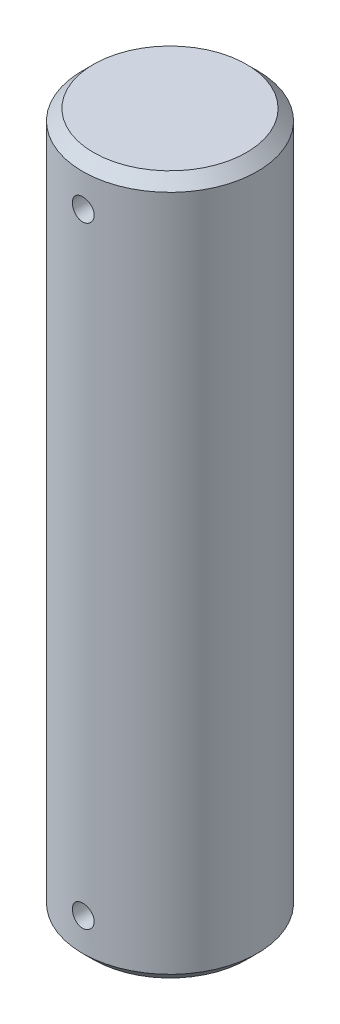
ISO-10303-21;
HEADER;
FILE_DESCRIPTION(('STEP AP214'),'2;1');
FILE_NAME('part.step','',(''),(''),'','','');
FILE_SCHEMA(('AUTOMOTIVE_DESIGN { 1 0 10303 214 1 1 1 1 }'));
ENDSEC;
DATA;
#1=APPLICATION_CONTEXT('core data for automotive mechanical design processes');
#2=APPLICATION_PROTOCOL_DEFINITION('international standard','automotive_design',2000,#1);
#3=PRODUCT_CONTEXT('',#1,'mechanical');
#4=PRODUCT('Part','Part','',(#3));
#5=PRODUCT_RELATED_PRODUCT_CATEGORY('part','',(#4));
#6=PRODUCT_DEFINITION_FORMATION('','',#4);
#7=PRODUCT_DEFINITION_CONTEXT('part definition',#1,'design');
#8=PRODUCT_DEFINITION('design','',#6,#7);
#9=PRODUCT_DEFINITION_SHAPE('','',#8);
#10=(LENGTH_UNIT() NAMED_UNIT(*) SI_UNIT(.MILLI.,.METRE.));
#11=(NAMED_UNIT(*) PLANE_ANGLE_UNIT() SI_UNIT($,.RADIAN.));
#12=(NAMED_UNIT(*) SI_UNIT($,.STERADIAN.) SOLID_ANGLE_UNIT());
#13=UNCERTAINTY_MEASURE_WITH_UNIT(LENGTH_MEASURE(1.E-05),#10,'distance_accuracy_value','');
#14=(GEOMETRIC_REPRESENTATION_CONTEXT(3) GLOBAL_UNCERTAINTY_ASSIGNED_CONTEXT((#13)) GLOBAL_UNIT_ASSIGNED_CONTEXT((#10,
#11,#12)) REPRESENTATION_CONTEXT('',''));
#15=CARTESIAN_POINT('',(0.,0.,0.));
#16=DIRECTION('',(0.,0.,1.));
#17=DIRECTION('',(1.,0.,0.));
#18=AXIS2_PLACEMENT_3D('',#15,#16,#17);
#19=CARTESIAN_POINT('',(0.,101.6,0.));
#20=DIRECTION('',(0.,-1.,0.));
#21=DIRECTION('',(0.,0.,-1.));
#22=AXIS2_PLACEMENT_3D('',#19,#20,#21);
#23=CYLINDRICAL_SURFACE('',#22,25.4);
#24=CARTESIAN_POINT('',(0.,98.425,0.));
#25=DIRECTION('',(0.,1.,0.));
#26=DIRECTION('',(0.,0.,1.));
#27=AXIS2_PLACEMENT_3D('',#24,#25,#26);
#28=CIRCLE('',#27,25.4);
#29=CARTESIAN_POINT('',(0.,98.425,25.4));
#30=VERTEX_POINT('',#29);
#31=EDGE_CURVE('E38',#30,#30,#28,.F.);
#32=ORIENTED_EDGE('',*,*,#31,.T.);
#33=EDGE_LOOP('',(#32));
#34=FACE_BOUND('',#33,.T.);
#35=CARTESIAN_POINT('',(0.,-98.425,0.));
#36=DIRECTION('',(0.,1.,0.));
#37=DIRECTION('',(0.,0.,1.));
#38=AXIS2_PLACEMENT_3D('',#35,#36,#37);
#39=CIRCLE('',#38,25.4);
#40=CARTESIAN_POINT('',(0.,-98.425,25.4));
#41=VERTEX_POINT('',#40);
#42=EDGE_CURVE('E42',#41,#41,#39,.T.);
#43=ORIENTED_EDGE('',*,*,#42,.T.);
#44=EDGE_LOOP('',(#43));
#45=FACE_BOUND('',#44,.T.);
#46=CARTESIAN_POINT('',(0.,-85.725,-25.4));
#47=CARTESIAN_POINT('',(-0.177598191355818,-85.7250075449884,-25.3999975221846));
#48=CARTESIAN_POINT('',(-0.355307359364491,-85.739951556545,-25.3981176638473));
#49=CARTESIAN_POINT('',(-0.705780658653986,-85.7993302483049,-25.3907993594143));
#50=CARTESIAN_POINT('',(-0.878539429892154,-85.8437957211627,-25.3853571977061));
#51=CARTESIAN_POINT('',(-1.21398738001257,-85.9608868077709,-25.371527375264));
#52=CARTESIAN_POINT('',(-1.37668325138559,-86.0334934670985,-25.3631416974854));
#53=CARTESIAN_POINT('',(-1.68754993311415,-86.2047644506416,-25.3443575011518));
#54=CARTESIAN_POINT('',(-1.83572322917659,-86.303424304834,-25.3339593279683));
#55=CARTESIAN_POINT('',(-2.11418527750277,-86.5245817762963,-25.3122470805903));
#56=CARTESIAN_POINT('',(-2.24438256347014,-86.6471941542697,-25.3009287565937));
#57=CARTESIAN_POINT('',(-2.48240904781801,-86.9125297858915,-25.2786861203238));
#58=CARTESIAN_POINT('',(-2.59023710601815,-87.0552540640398,-25.2677618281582));
#59=CARTESIAN_POINT('',(-2.7808049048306,-87.3573563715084,-25.2475022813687));
#60=CARTESIAN_POINT('',(-2.86345896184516,-87.5167888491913,-25.2381725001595));
#61=CARTESIAN_POINT('',(-3.00078530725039,-87.8474075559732,-25.2222143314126));
#62=CARTESIAN_POINT('',(-3.05545865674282,-88.0185933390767,-25.2155858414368));
#63=CARTESIAN_POINT('',(-3.13499370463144,-88.3669101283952,-25.2058213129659));
#64=CARTESIAN_POINT('',(-3.16000982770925,-88.5440053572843,-25.2026671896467));
#65=CARTESIAN_POINT('',(-3.17999814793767,-88.8999063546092,-25.2001531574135));
#66=CARTESIAN_POINT('',(-3.17497155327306,-89.0787120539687,-25.2007930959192));
#67=CARTESIAN_POINT('',(-3.13514389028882,-89.431882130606,-25.2057783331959));
#68=CARTESIAN_POINT('',(-3.10051292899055,-89.6062660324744,-25.2101024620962));
#69=CARTESIAN_POINT('',(-3.00272498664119,-89.9467276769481,-25.2219358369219));
#70=CARTESIAN_POINT('',(-2.9395674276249,-90.1128052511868,-25.2294451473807));
#71=CARTESIAN_POINT('',(-2.78633626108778,-90.4324683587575,-25.2468267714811));
#72=CARTESIAN_POINT('',(-2.69618873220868,-90.5860180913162,-25.2567055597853));
#73=CARTESIAN_POINT('',(-2.49158946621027,-90.8758745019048,-25.2777080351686));
#74=CARTESIAN_POINT('',(-2.37713661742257,-91.0121803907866,-25.2888317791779));
#75=CARTESIAN_POINT('',(-2.12623287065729,-91.2646672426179,-25.3111648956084));
#76=CARTESIAN_POINT('',(-1.9896353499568,-91.3807025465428,-25.3223743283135));
#77=CARTESIAN_POINT('',(-1.69882460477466,-91.5882202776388,-25.3435438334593));
#78=CARTESIAN_POINT('',(-1.54461133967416,-91.6797026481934,-25.3535039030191));
#79=CARTESIAN_POINT('',(-1.2228343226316,-91.8355177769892,-25.371058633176));
#80=CARTESIAN_POINT('',(-1.05526610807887,-91.8998414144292,-25.3786524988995));
#81=CARTESIAN_POINT('',(-0.711591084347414,-91.9993975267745,-25.3906119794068));
#82=CARTESIAN_POINT('',(-0.53548467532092,-92.0346313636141,-25.3949777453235));
#83=CARTESIAN_POINT('',(-0.180991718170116,-92.0748189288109,-25.3999694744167));
#84=CARTESIAN_POINT('',(-0.00262825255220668,-92.0799733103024,-25.4006202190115));
#85=CARTESIAN_POINT('',(0.352419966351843,-92.0603851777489,-25.398175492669));
#86=CARTESIAN_POINT('',(0.529104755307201,-92.0356433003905,-25.3950801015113));
#87=CARTESIAN_POINT('',(0.875188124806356,-91.9571316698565,-25.38550636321));
#88=CARTESIAN_POINT('',(1.0446087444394,-91.9034575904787,-25.3790391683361));
#89=CARTESIAN_POINT('',(1.3720440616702,-91.7687046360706,-25.3634458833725));
#90=CARTESIAN_POINT('',(1.53005837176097,-91.6876248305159,-25.3543197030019));
#91=CARTESIAN_POINT('',(1.83109174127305,-91.4998765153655,-25.3343641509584));
#92=CARTESIAN_POINT('',(1.97402927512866,-91.3930782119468,-25.3235262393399));
#93=CARTESIAN_POINT('',(2.24002217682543,-91.1571081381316,-25.3013863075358));
#94=CARTESIAN_POINT('',(2.36307675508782,-91.0279354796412,-25.2900842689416));
#95=CARTESIAN_POINT('',(2.5865225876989,-90.7499995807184,-25.2682134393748));
#96=CARTESIAN_POINT('',(2.68678083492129,-90.6011290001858,-25.2576491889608));
#97=CARTESIAN_POINT('',(2.86086916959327,-90.2885440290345,-25.2385247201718));
#98=CARTESIAN_POINT('',(2.93469978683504,-90.1248299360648,-25.229964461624));
#99=CARTESIAN_POINT('',(3.05362175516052,-89.7876343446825,-25.215848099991));
#100=CARTESIAN_POINT('',(3.09878809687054,-89.6141796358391,-25.2102841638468));
#101=CARTESIAN_POINT('',(3.15934089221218,-89.2620738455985,-25.2027679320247));
#102=CARTESIAN_POINT('',(3.17472873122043,-89.0834230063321,-25.2008154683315));
#103=CARTESIAN_POINT('',(3.17526230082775,-88.72731945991,-25.2007481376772));
#104=CARTESIAN_POINT('',(3.16061699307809,-88.5498670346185,-25.2026067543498));
#105=CARTESIAN_POINT('',(3.10194249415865,-88.1999669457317,-25.2098951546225));
#106=CARTESIAN_POINT('',(3.05791329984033,-88.0275192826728,-25.2153249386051));
#107=CARTESIAN_POINT('',(2.94178618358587,-87.6925513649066,-25.2291356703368));
#108=CARTESIAN_POINT('',(2.86969832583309,-87.5300275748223,-25.2375155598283));
#109=CARTESIAN_POINT('',(2.6995207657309,-87.2193497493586,-25.2562840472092));
#110=CARTESIAN_POINT('',(2.60143073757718,-87.0711958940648,-25.2666726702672));
#111=CARTESIAN_POINT('',(2.38125804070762,-86.7923953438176,-25.2883746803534));
#112=CARTESIAN_POINT('',(2.2590196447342,-86.6618720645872,-25.2996937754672));
#113=CARTESIAN_POINT('',(1.99434478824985,-86.4231103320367,-25.3219309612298));
#114=CARTESIAN_POINT('',(1.85190357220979,-86.3148771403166,-25.3328489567));
#115=CARTESIAN_POINT('',(1.55024533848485,-86.1234175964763,-25.3530996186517));
#116=CARTESIAN_POINT('',(1.39096658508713,-86.0402879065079,-25.3624260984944));
#117=CARTESIAN_POINT('',(1.06068228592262,-85.9020745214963,-25.3783801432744));
#118=CARTESIAN_POINT('',(0.889689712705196,-85.8469603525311,-25.3850106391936));
#119=CARTESIAN_POINT('',(0.598177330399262,-85.7795346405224,-25.3932273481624));
#120=CARTESIAN_POINT('',(0.479495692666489,-85.7591135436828,-25.3957547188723));
#121=CARTESIAN_POINT('',(0.240559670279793,-85.7318437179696,-25.3991418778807));
#122=CARTESIAN_POINT('',(0.120305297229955,-85.7249948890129,-25.4000016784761));
#123=CARTESIAN_POINT('',(0.,-85.725,-25.4));
#124=B_SPLINE_CURVE_WITH_KNOTS('',3,(#46,#47,#48,#49,#50,#51,#52,#53,#54,#55,#56,#57,#58,#59,
#60,#61,#62,#63,#64,#65,#66,#67,#68,#69,#70,#71,#72,#73,#74,#75,#76,#77,#78,#79,#80,#81,#82,#83,
#84,#85,#86,#87,#88,#89,#90,#91,#92,#93,#94,#95,#96,#97,#98,#99,#100,#101,#102,#103,#104,#105,
#106,#107,#108,#109,#110,#111,#112,#113,#114,#115,#116,#117,#118,#119,#120,#121,#122,#123),
.UNSPECIFIED.,.T.,.F.,(4,2,2,2,2,2,2,2,2,2,2,2,2,2,2,2,2,2,2,2,2,2,2,2,2,2,2,2,2,2,2,2,2,2,2,2,
2,2,4),(0.,0.532355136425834,1.06526642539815,1.59781939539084,2.13028105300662,2.6653593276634,
3.20046486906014,3.73737187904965,4.27425852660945,4.80833716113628,5.34239431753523,
5.87340324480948,6.40442293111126,6.93691051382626,7.46942245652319,8.00561617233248,
8.54181112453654,9.07818600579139,9.61453577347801,10.1473035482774,10.6800599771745,
11.2110653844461,11.7420888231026,12.2758505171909,12.8096334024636,13.3464550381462,
13.8832659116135,14.4186665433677,14.9540422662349,15.4857056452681,16.0173690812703,
16.5488419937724,17.0803215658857,17.6153475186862,18.1504996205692,18.687686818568,
19.2242884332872,19.5849093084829,19.9455275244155),.UNSPECIFIED.);
#125=CARTESIAN_POINT('',(0.,-85.725,-25.4));
#126=VERTEX_POINT('',#125);
#127=EDGE_CURVE('E52',#126,#126,#124,.T.);
#128=ORIENTED_EDGE('',*,*,#127,.T.);
#129=EDGE_LOOP('',(#128));
#130=FACE_BOUND('',#129,.T.);
#131=CARTESIAN_POINT('',(3.17500000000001,-88.9,25.2007812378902));
#132=CARTESIAN_POINT('',(3.1749924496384,-89.0775920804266,25.2007837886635));
#133=CARTESIAN_POINT('',(3.16004943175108,-89.2552951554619,25.2026787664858));
#134=CARTESIAN_POINT('',(3.10067504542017,-89.6057557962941,25.2100510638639));
#135=CARTESIAN_POINT('',(3.05621286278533,-89.7785079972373,25.2155321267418));
#136=CARTESIAN_POINT('',(2.93913139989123,-90.1139420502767,25.2294462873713));
#137=CARTESIAN_POINT('',(2.86653123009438,-90.2766306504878,25.2378773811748));
#138=CARTESIAN_POINT('',(2.69527553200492,-90.5874851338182,25.2567392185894));
#139=CARTESIAN_POINT('',(2.59662445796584,-90.7356534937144,25.2671696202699));
#140=CARTESIAN_POINT('',(2.37547588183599,-91.0141210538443,25.2889202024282));
#141=CARTESIAN_POINT('',(2.25286165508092,-91.1443272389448,25.3002445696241));
#142=CARTESIAN_POINT('',(1.98751858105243,-91.3823709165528,25.3224694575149));
#143=CARTESIAN_POINT('',(1.84478873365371,-91.4902072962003,25.333369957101));
#144=CARTESIAN_POINT('',(1.54268148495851,-91.680783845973,25.3535617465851));
#145=CARTESIAN_POINT('',(1.38325059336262,-91.7634398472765,25.362847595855));
#146=CARTESIAN_POINT('',(1.05263533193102,-91.900770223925,25.3787178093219));
#147=CARTESIAN_POINT('',(0.881451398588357,-91.9554456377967,25.3853022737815));
#148=CARTESIAN_POINT('',(0.533140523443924,-92.0349849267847,25.3949983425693));
#149=CARTESIAN_POINT('',(0.356049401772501,-92.0600034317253,25.3981279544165));
#150=CARTESIAN_POINT('',(0.000156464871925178,-92.0799979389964,25.400623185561));
#151=CARTESIAN_POINT('',(-0.178645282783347,-92.0749751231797,25.3999889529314));
#152=CARTESIAN_POINT('',(-0.531831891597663,-92.0351534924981,25.3950425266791));
#153=CARTESIAN_POINT('',(-0.706235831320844,-92.0005209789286,25.3907508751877));
#154=CARTESIAN_POINT('',(-1.04673674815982,-91.90272300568,25.3789949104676));
#155=CARTESIAN_POINT('',(-1.21283356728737,-91.8395570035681,25.3715305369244));
#156=CARTESIAN_POINT('',(-1.53252019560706,-91.6863082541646,25.3542324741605));
#157=CARTESIAN_POINT('',(-1.68607514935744,-91.5961535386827,25.3443924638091));
#158=CARTESIAN_POINT('',(-1.97593896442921,-91.3915388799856,25.3234440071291));
#159=CARTESIAN_POINT('',(-2.11224703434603,-91.2770778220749,25.3123355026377));
#160=CARTESIAN_POINT('',(-2.36472479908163,-91.02616819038,25.2900036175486));
#161=CARTESIAN_POINT('',(-2.4807504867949,-90.8895746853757,25.27877997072));
#162=CARTESIAN_POINT('',(-2.68825072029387,-90.5987754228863,25.2575577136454));
#163=CARTESIAN_POINT('',(-2.77972518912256,-90.4445696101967,25.2475591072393));
#164=CARTESIAN_POINT('',(-2.93553460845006,-90.1227947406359,25.2299190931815));
#165=CARTESIAN_POINT('',(-2.99985802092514,-89.9552200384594,25.2222786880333));
#166=CARTESIAN_POINT('',(-3.09941170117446,-89.6115308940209,25.2102396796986));
#167=CARTESIAN_POINT('',(-3.1346433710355,-89.4354168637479,25.2058409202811));
#168=CARTESIAN_POINT('',(-3.17482274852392,-89.0809201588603,25.2008117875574));
#169=CARTESIAN_POINT('',(-3.17997311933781,-88.9025607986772,25.2001561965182));
#170=CARTESIAN_POINT('',(-3.1603784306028,-88.5475217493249,25.2026209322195));
#171=CARTESIAN_POINT('',(-3.13563400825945,-88.3708420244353,25.2057411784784));
#172=CARTESIAN_POINT('',(-3.0571227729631,-88.0247848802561,25.2153830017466));
#173=CARTESIAN_POINT('',(-3.00345409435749,-87.8553848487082,25.2218930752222));
#174=CARTESIAN_POINT('',(-2.86871882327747,-87.5279883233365,25.2375716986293));
#175=CARTESIAN_POINT('',(-2.78765126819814,-87.3699922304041,25.2467403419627));
#176=CARTESIAN_POINT('',(-2.59992116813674,-87.0689716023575,25.2667634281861));
#177=CARTESIAN_POINT('',(-2.49312572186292,-86.9260305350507,25.2776265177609));
#178=CARTESIAN_POINT('',(-2.25715924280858,-86.6600291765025,25.299787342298));
#179=CARTESIAN_POINT('',(-2.12798733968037,-86.5369696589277,25.3110850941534));
#180=CARTESIAN_POINT('',(-1.85004935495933,-86.3135126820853,25.3329197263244));
#181=CARTESIAN_POINT('',(-1.70117578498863,-86.2132483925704,25.343451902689));
#182=CARTESIAN_POINT('',(-1.38858317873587,-86.0391494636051,25.3624983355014));
#183=CARTESIAN_POINT('',(-1.22486444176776,-85.9653142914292,25.371012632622));
#184=CARTESIAN_POINT('',(-0.8876714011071,-85.8463894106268,25.3850430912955));
#185=CARTESIAN_POINT('',(-0.714224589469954,-85.8012227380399,25.3905672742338));
#186=CARTESIAN_POINT('',(-0.362135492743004,-85.740666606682,25.3980283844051));
#187=CARTESIAN_POINT('',(-0.183493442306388,-85.725275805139,25.3999654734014));
#188=CARTESIAN_POINT('',(0.172614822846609,-85.724733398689,25.4000333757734));
#189=CARTESIAN_POINT('',(0.35008075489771,-85.7393764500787,25.3981900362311));
#190=CARTESIAN_POINT('',(0.700008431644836,-85.7980511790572,25.3909555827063));
#191=CARTESIAN_POINT('',(0.872470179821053,-85.842082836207,25.3855644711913));
#192=CARTESIAN_POINT('',(1.20746703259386,-85.958220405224,25.371837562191));
#193=CARTESIAN_POINT('',(1.37000559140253,-86.0303164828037,25.363502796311));
#194=CARTESIAN_POINT('',(1.68070953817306,-86.2005150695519,25.3448114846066));
#195=CARTESIAN_POINT('',(1.82887475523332,-86.2986178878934,25.3344549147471));
#196=CARTESIAN_POINT('',(2.10767519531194,-86.5188048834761,25.3127915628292));
#197=CARTESIAN_POINT('',(2.23818931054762,-86.6410418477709,25.3014790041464));
#198=CARTESIAN_POINT('',(2.47693322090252,-86.9057100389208,25.2792250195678));
#199=CARTESIAN_POINT('',(2.58515773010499,-87.048146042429,25.2682836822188));
#200=CARTESIAN_POINT('',(2.77660765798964,-87.3497998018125,25.247965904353));
#201=CARTESIAN_POINT('',(2.85973492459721,-87.5090802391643,25.2385956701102));
#202=CARTESIAN_POINT('',(2.99794331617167,-87.8393680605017,25.2225537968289));
#203=CARTESIAN_POINT('',(3.05305494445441,-88.0103624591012,25.2158792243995));
#204=CARTESIAN_POINT('',(3.12047368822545,-88.3018680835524,25.2076049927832));
#205=CARTESIAN_POINT('',(3.14089164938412,-88.4205406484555,25.2050588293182));
#206=CARTESIAN_POINT('',(3.16815731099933,-88.6594585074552,25.20164609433));
#207=CARTESIAN_POINT('',(3.17500511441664,-88.7797037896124,25.2007795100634));
#208=CARTESIAN_POINT('',(3.17500000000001,-88.9,25.2007812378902));
#209=B_SPLINE_CURVE_WITH_KNOTS('',3,(#131,#132,#133,#134,#135,#136,#137,#138,#139,#140,#141,
#142,#143,#144,#145,#146,#147,#148,#149,#150,#151,#152,#153,#154,#155,#156,#157,#158,#159,#160,
#161,#162,#163,#164,#165,#166,#167,#168,#169,#170,#171,#172,#173,#174,#175,#176,#177,#178,#179,
#180,#181,#182,#183,#184,#185,#186,#187,#188,#189,#190,#191,#192,#193,#194,#195,#196,#197,#198,
#199,#200,#201,#202,#203,#204,#205,#206,#207,#208),.UNSPECIFIED.,.T.,.F.,(4,2,2,2,2,2,2,2,2,2,2,
2,2,2,2,2,2,2,2,2,2,2,2,2,2,2,2,2,2,2,2,2,2,2,2,2,2,2,4),(0.,0.532336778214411,1.06523012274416,
1.59776217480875,2.1302032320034,2.66530553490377,3.20043445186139,3.73733296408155,
4.27421154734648,4.80827838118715,5.34232420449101,5.87339014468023,6.40446618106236,
6.93697119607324,7.46950063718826,8.00566975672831,8.54184055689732,9.07823897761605,
9.61461154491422,10.1473662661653,10.680109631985,11.2110567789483,11.7420225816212,
12.2757923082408,12.8095828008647,13.3464158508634,13.8832380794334,14.4186129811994,
14.9539637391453,15.4856664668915,16.0173688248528,16.5488850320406,17.0804075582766,
17.6154096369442,18.1505384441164,18.6877337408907,19.2243428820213,19.5849365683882,
19.9455275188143),.UNSPECIFIED.);
#210=CARTESIAN_POINT('',(3.17500000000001,-88.9,25.2007812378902));
#211=VERTEX_POINT('',#210);
#212=EDGE_CURVE('E60',#211,#211,#209,.T.);
#213=ORIENTED_EDGE('',*,*,#212,.T.);
#214=EDGE_LOOP('',(#213));
#215=FACE_BOUND('',#214,.T.);
#216=CARTESIAN_POINT('',(0.,92.075,-25.4));
#217=CARTESIAN_POINT('',(-0.177598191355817,92.0749924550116,-25.3999975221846));
#218=CARTESIAN_POINT('',(-0.355307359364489,92.060048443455,-25.3981176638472));
#219=CARTESIAN_POINT('',(-0.705780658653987,92.0006697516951,-25.3907993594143));
#220=CARTESIAN_POINT('',(-0.878539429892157,91.9562042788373,-25.3853571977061));
#221=CARTESIAN_POINT('',(-1.21398738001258,91.8391131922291,-25.371527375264));
#222=CARTESIAN_POINT('',(-1.3766832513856,91.7665065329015,-25.3631416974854));
#223=CARTESIAN_POINT('',(-1.68754993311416,91.5952355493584,-25.3443575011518));
#224=CARTESIAN_POINT('',(-1.83572322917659,91.496575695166,-25.3339593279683));
#225=CARTESIAN_POINT('',(-2.11418527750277,91.2754182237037,-25.3122470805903));
#226=CARTESIAN_POINT('',(-2.24438256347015,91.1528058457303,-25.3009287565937));
#227=CARTESIAN_POINT('',(-2.48240904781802,90.8874702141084,-25.2786861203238));
#228=CARTESIAN_POINT('',(-2.59023710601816,90.7447459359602,-25.2677618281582));
#229=CARTESIAN_POINT('',(-2.7808049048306,90.4426436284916,-25.2475022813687));
#230=CARTESIAN_POINT('',(-2.86345896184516,90.2832111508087,-25.2381725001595));
#231=CARTESIAN_POINT('',(-3.00078530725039,89.9525924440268,-25.2222143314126));
#232=CARTESIAN_POINT('',(-3.05545865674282,89.7814066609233,-25.2155858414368));
#233=CARTESIAN_POINT('',(-3.13499370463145,89.4330898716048,-25.2058213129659));
#234=CARTESIAN_POINT('',(-3.16000982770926,89.2559946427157,-25.2026671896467));
#235=CARTESIAN_POINT('',(-3.17999814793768,88.9000936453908,-25.2001531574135));
#236=CARTESIAN_POINT('',(-3.17497155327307,88.7212879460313,-25.2007930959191));
#237=CARTESIAN_POINT('',(-3.13514389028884,88.368117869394,-25.2057783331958));
#238=CARTESIAN_POINT('',(-3.10051292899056,88.1937339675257,-25.2101024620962));
#239=CARTESIAN_POINT('',(-3.00272498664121,87.8532723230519,-25.2219358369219));
#240=CARTESIAN_POINT('',(-2.93956742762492,87.6871947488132,-25.2294451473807));
#241=CARTESIAN_POINT('',(-2.78633626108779,87.3675316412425,-25.2468267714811));
#242=CARTESIAN_POINT('',(-2.69618873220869,87.2139819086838,-25.2567055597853));
#243=CARTESIAN_POINT('',(-2.49158946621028,86.9241254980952,-25.2777080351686));
#244=CARTESIAN_POINT('',(-2.37713661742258,86.7878196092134,-25.2888317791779));
#245=CARTESIAN_POINT('',(-2.1262328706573,86.5353327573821,-25.3111648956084));
#246=CARTESIAN_POINT('',(-1.98963534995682,86.4192974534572,-25.3223743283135));
#247=CARTESIAN_POINT('',(-1.69882460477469,86.2117797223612,-25.3435438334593));
#248=CARTESIAN_POINT('',(-1.54461133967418,86.1202973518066,-25.3535039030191));
#249=CARTESIAN_POINT('',(-1.22283432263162,85.9644822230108,-25.371058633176));
#250=CARTESIAN_POINT('',(-1.0552661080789,85.9001585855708,-25.3786524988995));
#251=CARTESIAN_POINT('',(-0.711591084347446,85.8006024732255,-25.3906119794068));
#252=CARTESIAN_POINT('',(-0.535484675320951,85.7653686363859,-25.3949777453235));
#253=CARTESIAN_POINT('',(-0.180991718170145,85.7251810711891,-25.3999694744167));
#254=CARTESIAN_POINT('',(-0.00262825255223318,85.7200266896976,-25.4006202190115));
#255=CARTESIAN_POINT('',(0.35241996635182,85.7396148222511,-25.398175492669));
#256=CARTESIAN_POINT('',(0.529104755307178,85.7643566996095,-25.3950801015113));
#257=CARTESIAN_POINT('',(0.875188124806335,85.8428683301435,-25.38550636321));
#258=CARTESIAN_POINT('',(1.04460874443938,85.8965424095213,-25.3790391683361));
#259=CARTESIAN_POINT('',(1.37204406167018,86.0312953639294,-25.3634458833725));
#260=CARTESIAN_POINT('',(1.53005837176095,86.1123751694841,-25.3543197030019));
#261=CARTESIAN_POINT('',(1.83109174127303,86.3001234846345,-25.3343641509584));
#262=CARTESIAN_POINT('',(1.97402927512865,86.4069217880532,-25.3235262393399));
#263=CARTESIAN_POINT('',(2.24002217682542,86.6428918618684,-25.3013863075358));
#264=CARTESIAN_POINT('',(2.36307675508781,86.7720645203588,-25.2900842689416));
#265=CARTESIAN_POINT('',(2.58652258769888,87.0500004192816,-25.2682134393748));
#266=CARTESIAN_POINT('',(2.68678083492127,87.1988709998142,-25.2576491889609));
#267=CARTESIAN_POINT('',(2.86086916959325,87.5114559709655,-25.2385247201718));
#268=CARTESIAN_POINT('',(2.93469978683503,87.6751700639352,-25.229964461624));
#269=CARTESIAN_POINT('',(3.05362175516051,88.0123656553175,-25.215848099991));
#270=CARTESIAN_POINT('',(3.09878809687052,88.1858203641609,-25.2102841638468));
#271=CARTESIAN_POINT('',(3.15934089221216,88.5379261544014,-25.2027679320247));
#272=CARTESIAN_POINT('',(3.17472873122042,88.7165769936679,-25.2008154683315));
#273=CARTESIAN_POINT('',(3.17526230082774,89.0726805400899,-25.2007481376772));
#274=CARTESIAN_POINT('',(3.16061699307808,89.2501329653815,-25.2026067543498));
#275=CARTESIAN_POINT('',(3.10194249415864,89.6000330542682,-25.2098951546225));
#276=CARTESIAN_POINT('',(3.05791329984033,89.7724807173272,-25.2153249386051));
#277=CARTESIAN_POINT('',(2.94178618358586,90.1074486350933,-25.2291356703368));
#278=CARTESIAN_POINT('',(2.86969832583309,90.2699724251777,-25.2375155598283));
#279=CARTESIAN_POINT('',(2.6995207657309,90.5806502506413,-25.2562840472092));
#280=CARTESIAN_POINT('',(2.60143073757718,90.7288041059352,-25.2666726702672));
#281=CARTESIAN_POINT('',(2.38125804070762,91.0076046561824,-25.2883746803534));
#282=CARTESIAN_POINT('',(2.25901964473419,91.1381279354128,-25.2996937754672));
#283=CARTESIAN_POINT('',(1.99434478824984,91.3768896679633,-25.3219309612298));
#284=CARTESIAN_POINT('',(1.85190357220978,91.4851228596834,-25.3328489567));
#285=CARTESIAN_POINT('',(1.55024533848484,91.6765824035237,-25.3530996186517));
#286=CARTESIAN_POINT('',(1.39096658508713,91.7597120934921,-25.3624260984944));
#287=CARTESIAN_POINT('',(1.06068228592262,91.8979254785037,-25.3783801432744));
#288=CARTESIAN_POINT('',(0.889689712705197,91.9530396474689,-25.3850106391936));
#289=CARTESIAN_POINT('',(0.598177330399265,92.0204653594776,-25.3932273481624));
#290=CARTESIAN_POINT('',(0.47949569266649,92.0408864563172,-25.3957547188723));
#291=CARTESIAN_POINT('',(0.240559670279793,92.0681562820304,-25.3991418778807));
#292=CARTESIAN_POINT('',(0.120305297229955,92.0750051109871,-25.4000016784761));
#293=CARTESIAN_POINT('',(0.,92.075,-25.4));
#294=B_SPLINE_CURVE_WITH_KNOTS('',3,(#216,#217,#218,#219,#220,#221,#222,#223,#224,#225,#226,
#227,#228,#229,#230,#231,#232,#233,#234,#235,#236,#237,#238,#239,#240,#241,#242,#243,#244,#245,
#246,#247,#248,#249,#250,#251,#252,#253,#254,#255,#256,#257,#258,#259,#260,#261,#262,#263,#264,
#265,#266,#267,#268,#269,#270,#271,#272,#273,#274,#275,#276,#277,#278,#279,#280,#281,#282,#283,
#284,#285,#286,#287,#288,#289,#290,#291,#292,#293),.UNSPECIFIED.,.T.,.F.,(4,2,2,2,2,2,2,2,2,2,2,
2,2,2,2,2,2,2,2,2,2,2,2,2,2,2,2,2,2,2,2,2,2,2,2,2,2,2,4),(0.,0.532355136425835,1.06526642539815,
1.59781939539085,2.13028105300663,2.66535932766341,3.20046486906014,3.73737187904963,
4.27425852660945,4.80833716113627,5.34239431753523,5.87340324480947,6.40442293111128,
6.93691051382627,7.4694224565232,8.00561617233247,8.54181112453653,9.07818600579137,
9.614535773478,10.1473035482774,10.6800599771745,11.2110653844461,11.7420888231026,
12.275850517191,12.8096334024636,13.3464550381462,13.8832659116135,14.4186665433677,
14.9540422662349,15.4857056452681,16.0173690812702,16.5488419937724,17.0803215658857,
17.6153475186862,18.1504996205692,18.687686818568,19.2242884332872,19.5849093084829,
19.9455275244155),.UNSPECIFIED.);
#295=CARTESIAN_POINT('',(0.,92.075,-25.4));
#296=VERTEX_POINT('',#295);
#297=EDGE_CURVE('E51',#296,#296,#294,.T.);
#298=ORIENTED_EDGE('',*,*,#297,.T.);
#299=EDGE_LOOP('',(#298));
#300=FACE_BOUND('',#299,.T.);
#301=CARTESIAN_POINT('',(3.175,88.9,25.2007812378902));
#302=CARTESIAN_POINT('',(3.17499244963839,88.7224079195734,25.2007837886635));
#303=CARTESIAN_POINT('',(3.16004943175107,88.5447048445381,25.2026787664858));
#304=CARTESIAN_POINT('',(3.10067504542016,88.1942442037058,25.2100510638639));
#305=CARTESIAN_POINT('',(3.05621286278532,88.0214920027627,25.2155321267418));
#306=CARTESIAN_POINT('',(2.93913139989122,87.6860579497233,25.2294462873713));
#307=CARTESIAN_POINT('',(2.86653123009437,87.5233693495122,25.2378773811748));
#308=CARTESIAN_POINT('',(2.6952755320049,87.2125148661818,25.2567392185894));
#309=CARTESIAN_POINT('',(2.59662445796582,87.0643465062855,25.2671696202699));
#310=CARTESIAN_POINT('',(2.37547588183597,86.7858789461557,25.2889202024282));
#311=CARTESIAN_POINT('',(2.2528616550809,86.6556727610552,25.3002445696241));
#312=CARTESIAN_POINT('',(1.98751858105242,86.4176290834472,25.3224694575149));
#313=CARTESIAN_POINT('',(1.84478873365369,86.3097927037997,25.333369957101));
#314=CARTESIAN_POINT('',(1.54268148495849,86.119216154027,25.3535617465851));
#315=CARTESIAN_POINT('',(1.38325059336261,86.0365601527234,25.362847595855));
#316=CARTESIAN_POINT('',(1.05263533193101,85.8992297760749,25.3787178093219));
#317=CARTESIAN_POINT('',(0.881451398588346,85.8445543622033,25.3853022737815));
#318=CARTESIAN_POINT('',(0.533140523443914,85.7650150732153,25.3949983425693));
#319=CARTESIAN_POINT('',(0.35604940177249,85.7399965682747,25.3981279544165));
#320=CARTESIAN_POINT('',(0.000156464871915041,85.7200020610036,25.400623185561));
#321=CARTESIAN_POINT('',(-0.178645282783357,85.7250248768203,25.3999889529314));
#322=CARTESIAN_POINT('',(-0.531831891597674,85.7648465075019,25.3950425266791));
#323=CARTESIAN_POINT('',(-0.706235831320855,85.7994790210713,25.3907508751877));
#324=CARTESIAN_POINT('',(-1.04673674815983,85.89727699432,25.3789949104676));
#325=CARTESIAN_POINT('',(-1.21283356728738,85.9604429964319,25.3715305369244));
#326=CARTESIAN_POINT('',(-1.53252019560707,86.1136917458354,25.3542324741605));
#327=CARTESIAN_POINT('',(-1.68607514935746,86.2038464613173,25.3443924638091));
#328=CARTESIAN_POINT('',(-1.97593896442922,86.4084611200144,25.3234440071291));
#329=CARTESIAN_POINT('',(-2.11224703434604,86.5229221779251,25.3123355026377));
#330=CARTESIAN_POINT('',(-2.36472479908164,86.7738318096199,25.2900036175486));
#331=CARTESIAN_POINT('',(-2.48075048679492,86.9104253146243,25.27877997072));
#332=CARTESIAN_POINT('',(-2.68825072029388,87.2012245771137,25.2575577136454));
#333=CARTESIAN_POINT('',(-2.77972518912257,87.3554303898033,25.2475591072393));
#334=CARTESIAN_POINT('',(-2.93553460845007,87.6772052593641,25.2299190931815));
#335=CARTESIAN_POINT('',(-2.99985802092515,87.8447799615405,25.2222786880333));
#336=CARTESIAN_POINT('',(-3.09941170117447,88.1884691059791,25.2102396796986));
#337=CARTESIAN_POINT('',(-3.13464337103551,88.3645831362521,25.2058409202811));
#338=CARTESIAN_POINT('',(-3.17482274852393,88.7190798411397,25.2008117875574));
#339=CARTESIAN_POINT('',(-3.17997311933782,88.8974392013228,25.2001561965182));
#340=CARTESIAN_POINT('',(-3.16037843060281,89.2524782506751,25.2026209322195));
#341=CARTESIAN_POINT('',(-3.13563400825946,89.4291579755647,25.2057411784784));
#342=CARTESIAN_POINT('',(-3.05712277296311,89.7752151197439,25.2153830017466));
#343=CARTESIAN_POINT('',(-3.0034540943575,89.9446151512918,25.2218930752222));
#344=CARTESIAN_POINT('',(-2.86871882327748,90.2720116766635,25.2375716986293));
#345=CARTESIAN_POINT('',(-2.78765126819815,90.4300077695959,25.2467403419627));
#346=CARTESIAN_POINT('',(-2.59992116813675,90.7310283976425,25.2667634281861));
#347=CARTESIAN_POINT('',(-2.49312572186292,90.8739694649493,25.2776265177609));
#348=CARTESIAN_POINT('',(-2.25715924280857,91.1399708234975,25.299787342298));
#349=CARTESIAN_POINT('',(-2.12798733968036,91.2630303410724,25.3110850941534));
#350=CARTESIAN_POINT('',(-1.85004935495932,91.4864873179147,25.3329197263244));
#351=CARTESIAN_POINT('',(-1.70117578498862,91.5867516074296,25.343451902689));
#352=CARTESIAN_POINT('',(-1.38858317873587,91.7608505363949,25.3624983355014));
#353=CARTESIAN_POINT('',(-1.22486444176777,91.8346857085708,25.371012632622));
#354=CARTESIAN_POINT('',(-0.887671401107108,91.9536105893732,25.3850430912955));
#355=CARTESIAN_POINT('',(-0.714224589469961,91.9987772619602,25.3905672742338));
#356=CARTESIAN_POINT('',(-0.36213549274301,92.059333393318,25.3980283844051));
#357=CARTESIAN_POINT('',(-0.183493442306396,92.074724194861,25.3999654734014));
#358=CARTESIAN_POINT('',(0.1726148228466,92.075266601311,25.4000333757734));
#359=CARTESIAN_POINT('',(0.350080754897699,92.0606235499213,25.3981900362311));
#360=CARTESIAN_POINT('',(0.700008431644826,92.0019488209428,25.3909555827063));
#361=CARTESIAN_POINT('',(0.872470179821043,91.957917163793,25.3855644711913));
#362=CARTESIAN_POINT('',(1.20746703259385,91.841779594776,25.371837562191));
#363=CARTESIAN_POINT('',(1.37000559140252,91.7696835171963,25.363502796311));
#364=CARTESIAN_POINT('',(1.68070953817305,91.5994849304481,25.3448114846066));
#365=CARTESIAN_POINT('',(1.82887475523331,91.5013821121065,25.3344549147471));
#366=CARTESIAN_POINT('',(2.10767519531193,91.2811951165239,25.3127915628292));
#367=CARTESIAN_POINT('',(2.23818931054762,91.1589581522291,25.3014790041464));
#368=CARTESIAN_POINT('',(2.47693322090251,90.8942899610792,25.2792250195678));
#369=CARTESIAN_POINT('',(2.58515773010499,90.751853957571,25.2682836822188));
#370=CARTESIAN_POINT('',(2.77660765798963,90.4502001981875,25.247965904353));
#371=CARTESIAN_POINT('',(2.8597349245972,90.2909197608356,25.2385956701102));
#372=CARTESIAN_POINT('',(2.99794331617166,89.9606319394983,25.2225537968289));
#373=CARTESIAN_POINT('',(3.0530549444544,89.7896375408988,25.2158792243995));
#374=CARTESIAN_POINT('',(3.12047368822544,89.4981319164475,25.2076049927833));
#375=CARTESIAN_POINT('',(3.14089164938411,89.3794593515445,25.2050588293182));
#376=CARTESIAN_POINT('',(3.16815731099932,89.1405414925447,25.20164609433));
#377=CARTESIAN_POINT('',(3.17500511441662,89.0202962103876,25.2007795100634));
#378=CARTESIAN_POINT('',(3.175,88.9,25.2007812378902));
#379=B_SPLINE_CURVE_WITH_KNOTS('',3,(#301,#302,#303,#304,#305,#306,#307,#308,#309,#310,#311,
#312,#313,#314,#315,#316,#317,#318,#319,#320,#321,#322,#323,#324,#325,#326,#327,#328,#329,#330,
#331,#332,#333,#334,#335,#336,#337,#338,#339,#340,#341,#342,#343,#344,#345,#346,#347,#348,#349,
#350,#351,#352,#353,#354,#355,#356,#357,#358,#359,#360,#361,#362,#363,#364,#365,#366,#367,#368,
#369,#370,#371,#372,#373,#374,#375,#376,#377,#378),.UNSPECIFIED.,.T.,.F.,(4,2,2,2,2,2,2,2,2,2,2,
2,2,2,2,2,2,2,2,2,2,2,2,2,2,2,2,2,2,2,2,2,2,2,2,2,2,2,4),(0.,0.532336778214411,1.06523012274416,
1.59776217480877,2.13020323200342,2.66530553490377,3.20043445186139,3.73733296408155,
4.27421154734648,4.80827838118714,5.34232420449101,5.87339014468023,6.40446618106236,
6.93697119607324,7.46950063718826,8.00566975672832,8.54184055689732,9.07823897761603,
9.61461154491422,10.1473662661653,10.680109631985,11.2110567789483,11.7420225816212,
12.2757923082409,12.8095828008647,13.3464158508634,13.8832380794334,14.4186129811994,
14.9539637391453,15.4856664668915,16.0173688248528,16.5488850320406,17.0804075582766,
17.6154096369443,18.1505384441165,18.6877337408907,19.2243428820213,19.5849365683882,
19.9455275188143),.UNSPECIFIED.);
#380=CARTESIAN_POINT('',(3.175,88.9,25.2007812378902));
#381=VERTEX_POINT('',#380);
#382=EDGE_CURVE('E59',#381,#381,#379,.T.);
#383=ORIENTED_EDGE('',*,*,#382,.T.);
#384=EDGE_LOOP('',(#383));
#385=FACE_BOUND('',#384,.T.);
#386=ADVANCED_FACE('F31',(#34,#45,#130,#215,#300,#385),#23,.T.);
#387=CARTESIAN_POINT('',(0.,101.6,0.));
#388=DIRECTION('',(0.,1.,0.));
#389=DIRECTION('',(0.,0.,1.));
#390=AXIS2_PLACEMENT_3D('',#387,#388,#389);
#391=PLANE('',#390);
#392=CARTESIAN_POINT('',(0.,101.6,0.));
#393=DIRECTION('',(0.,1.,0.));
#394=DIRECTION('',(0.,0.,1.));
#395=AXIS2_PLACEMENT_3D('',#392,#393,#394);
#396=CIRCLE('',#395,22.225);
#397=CARTESIAN_POINT('',(0.,101.6,22.225));
#398=VERTEX_POINT('',#397);
#399=EDGE_CURVE('E46',#398,#398,#396,.T.);
#400=ORIENTED_EDGE('',*,*,#399,.T.);
#401=EDGE_LOOP('',(#400));
#402=FACE_BOUND('',#401,.T.);
#403=ADVANCED_FACE('F79',(#402),#391,.T.);
#404=CARTESIAN_POINT('',(0.,-101.6,0.));
#405=DIRECTION('',(0.,1.,0.));
#406=DIRECTION('',(0.,0.,1.));
#407=AXIS2_PLACEMENT_3D('',#404,#405,#406);
#408=PLANE('',#407);
#409=CARTESIAN_POINT('',(0.,-101.6,0.));
#410=DIRECTION('',(0.,1.,0.));
#411=DIRECTION('',(0.,0.,1.));
#412=AXIS2_PLACEMENT_3D('',#409,#410,#411);
#413=CIRCLE('',#412,22.225);
#414=CARTESIAN_POINT('',(0.,-101.6,22.225));
#415=VERTEX_POINT('',#414);
#416=EDGE_CURVE('E10',#415,#415,#413,.F.);
#417=ORIENTED_EDGE('',*,*,#416,.T.);
#418=EDGE_LOOP('',(#417));
#419=FACE_BOUND('',#418,.T.);
#420=ADVANCED_FACE('F77',(#419),#408,.F.);
#421=CARTESIAN_POINT('',(0.,88.9,-31.75));
#422=DIRECTION('',(0.,0.,1.));
#423=DIRECTION('',(1.,0.,0.));
#424=AXIS2_PLACEMENT_3D('',#421,#422,#423);
#425=CYLINDRICAL_SURFACE('',#424,3.175);
#426=ORIENTED_EDGE('',*,*,#382,.F.);
#427=EDGE_LOOP('',(#426));
#428=FACE_BOUND('',#427,.T.);
#429=ORIENTED_EDGE('',*,*,#297,.F.);
#430=EDGE_LOOP('',(#429));
#431=FACE_BOUND('',#430,.T.);
#432=ADVANCED_FACE('F71',(#428,#431),#425,.F.);
#433=CARTESIAN_POINT('',(0.,-88.9,-31.75));
#434=DIRECTION('',(0.,0.,1.));
#435=DIRECTION('',(1.,0.,0.));
#436=AXIS2_PLACEMENT_3D('',#433,#434,#435);
#437=CYLINDRICAL_SURFACE('',#436,3.175);
#438=ORIENTED_EDGE('',*,*,#212,.F.);
#439=EDGE_LOOP('',(#438));
#440=FACE_BOUND('',#439,.T.);
#441=ORIENTED_EDGE('',*,*,#127,.F.);
#442=EDGE_LOOP('',(#441));
#443=FACE_BOUND('',#442,.T.);
#444=ADVANCED_FACE('F66',(#440,#443),#437,.F.);
#445=CARTESIAN_POINT('',(0.,101.6,0.));
#446=DIRECTION('',(0.,-1.,0.));
#447=DIRECTION('',(0.,0.,-1.));
#448=AXIS2_PLACEMENT_3D('',#445,#446,#447);
#449=CONICAL_SURFACE('',#448,22.225,0.78539816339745);
#450=ORIENTED_EDGE('',*,*,#31,.F.);
#451=EDGE_LOOP('',(#450));
#452=FACE_BOUND('',#451,.T.);
#453=ORIENTED_EDGE('',*,*,#399,.F.);
#454=EDGE_LOOP('',(#453));
#455=FACE_BOUND('',#454,.T.);
#456=ADVANCED_FACE('F70',(#452,#455),#449,.T.);
#457=CARTESIAN_POINT('',(0.,-98.425,0.));
#458=DIRECTION('',(0.,1.,0.));
#459=DIRECTION('',(0.,0.,1.));
#460=AXIS2_PLACEMENT_3D('',#457,#458,#459);
#461=CONICAL_SURFACE('',#460,25.4,0.785398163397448);
#462=ORIENTED_EDGE('',*,*,#416,.F.);
#463=EDGE_LOOP('',(#462));
#464=FACE_BOUND('',#463,.T.);
#465=ORIENTED_EDGE('',*,*,#42,.F.);
#466=EDGE_LOOP('',(#465));
#467=FACE_BOUND('',#466,.T.);
#468=ADVANCED_FACE('F33',(#464,#467),#461,.T.);
#469=CLOSED_SHELL('',(#386,#403,#420,#432,#444,#456,#468));
#470=MANIFOLD_SOLID_BREP('B2',#469);
#471=ADVANCED_BREP_SHAPE_REPRESENTATION('',(#18,#470),#14);
#472=SHAPE_DEFINITION_REPRESENTATION(#9,#471);
ENDSEC;
END-ISO-10303-21;
